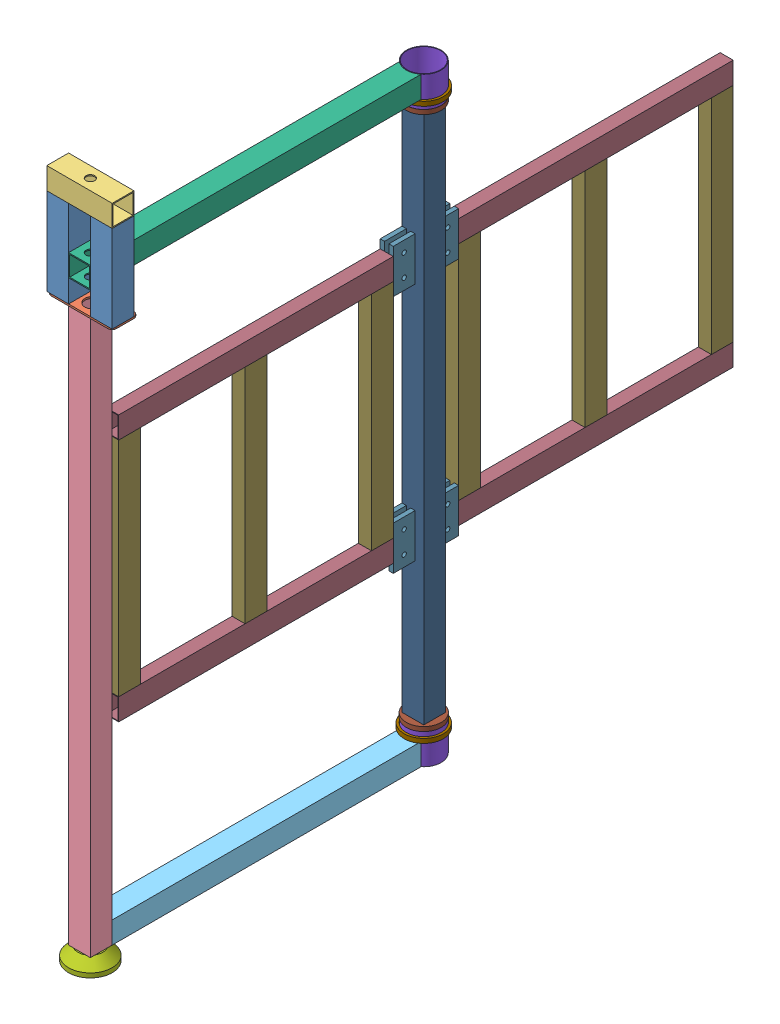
SolidWorks assembly simulation.SLDASM, configuration Default (file format 11000). Lengths in mm.
Overall size (150 1554 1520).
35 component instances, 14 part files, 39 mates.
Components (placement in the parent):
- adjuster pillars-1: adjuster pillars.SLDPRT [Default] at (28.9556 42.177 151.947) size (50 200 50)
- adjuster pillars-2: adjuster pillars.SLDPRT [Default] at (128.9556 42.177 151.947) size (50 200 50)
- base of adjuster-1: base of adjuster.SLDPRT [Default] at (78.9556 38.177 146.947) x (0 0 -1) z (1 0 0) size (60 4 150)
- top part of adjuster-1: top part of adjuster.SLDPRT [Default] at (153.9556 267.177 151.947) x (0 0 -1) z (0 1 0) size (50 150 50)
- pillar-1: pillar.SLDPRT [Default] at (78.9556 -1231.823 151.947) size (50 1270 50)
- bottom beam-1: bottom beam.SLDPRT [Default] at (78.9556 -1206.823 -613.053) x (0 1 0) z (1 0 0) size (50 708.78 50)
- top beam-1: top beam.SLDPRT [Default] at (78.9556 119.177 -613.0456) x (0 -1 0) z (-1 0 0) size (50 758.78 50)
- bases-1: bases.SLDPRT [Default] at (78.9556 -1261.823 151.947) size (100 30 100)
- pivot-1: pivot.SLDPRT [Default] at (78.9556 -1231.823 -613.053) x (-0.917246 0 0.398321) z (-0.398321 0 -0.917246) size (79.5 70 79.5)
- pivot-2: pivot.SLDPRT [Default] at (78.9556 74.177 -613.0456) x (0.999951 0 0.009934) z (-0.009934 0 0.999951) size (79.5 70 79.5)
- abstract for pivot and bearing-1: abstract for pivot and bearing.SLDPRT [Default] at (78.9556 -1181.823 -613.053) x (-0.462085 0 0.886835) z (-0.886835 0 -0.462085) size (90 10 90)
- abstract for pivot and bearing-2: abstract for pivot and bearing.SLDPRT [Default] at (78.9556 84.177 -613.0456) size (90 10 90)
- rotaric shaft-2: rotaric shaft.SLDPRT [Default] at (78.9556 -1151.823 -613.053) x (0 0 -1) z (1 0 0) size (50 1216 50)
- Part2-1: Part2.SLDPRT [Default] at (78.9556 -1161.823 -613.053) x (0.997465 0 0.071162) z (-0.071162 0 0.997465) size (80 10 80)
- Part2-2: Part2.SLDPRT [Default] at (78.9556 64.177 -613.0456) x (0.997465 0 0.071162) z (-0.071162 0 0.997465) size (80 10 80)
- blade-3: blade.SLDASM [Default] at (-409.4121 -785.2907 -312.4738) x (0 0 -1) z (1 0 0) size (680 650 30)
  - blades clumns-1: blades clumns.SLDPRT [Default] at (200.5792 19.4678 478.3677) size (50 510 30)
  - blades clumns-2: blades clumns.SLDPRT [Default] at (-89.4208 529.4678 478.3677) x (-1 0 0) z (0 0 1) size (50 510 30)
  - blades beam-1: blades beam.SLDPRT [Default] at (-404.4208 554.4678 478.3677) x (0 0 -1) z (0 -1 0) size (30 630 50)
  - blades beam-2: blades beam.SLDPRT [Default] at (225.5792 -5.5322 478.3677) x (0 0 1) z (0 -1 0) size (30 630 50)
  - blades clumns-3: blades clumns.SLDPRT [Default] at (-379.4208 19.4678 478.3677) size (50 510 30)
  - blades patch-1: blades patch.SLDPRT [Default] at (250.5792 549.4678 493.3677) x (0 1 0) z (-1 0 0) size (100 10 50)
  - blades patch-2: blades patch.SLDPRT [Default] at (250.5792 -0.5322 493.3677) x (0 1 0) z (-1 0 0) size (100 10 50)
  - blades patch-3: blades patch.SLDPRT [Default] at (250.5792 549.4678 473.3677) x (0 1 0) z (-1 0 0) size (100 10 50)
  - blades patch-6: blades patch.SLDPRT [Default] at (250.5792 -0.5322 473.3677) x (0 1 0) z (-1 0 0) size (100 10 50)
- blade-4: blade.SLDASM [Default] at (-409.4121 -236.3552 -913.6322) x (0 0 1) z (1 0 0) size (680 650 30)
  - blades clumns-1: blades clumns.SLDPRT [Default] at (200.5792 19.4678 478.3677) size (50 510 30)
  - blades clumns-2: blades clumns.SLDPRT [Default] at (-89.4208 529.4678 478.3677) x (-1 0 0) z (0 0 1) size (50 510 30)
  - blades beam-1: blades beam.SLDPRT [Default] at (-404.4208 554.4678 478.3677) x (0 0 -1) z (0 -1 0) size (30 630 50)
  - blades beam-2: blades beam.SLDPRT [Default] at (225.5792 -5.5322 478.3677) x (0 0 1) z (0 -1 0) size (30 630 50)
  - blades clumns-3: blades clumns.SLDPRT [Default] at (-379.4208 19.4678 478.3677) size (50 510 30)
  - blades patch-1: blades patch.SLDPRT [Default] at (250.5792 549.4678 493.3677) x (0 1 0) z (-1 0 0) size (100 10 50)
  - blades patch-2: blades patch.SLDPRT [Default] at (250.5792 -0.5322 493.3677) x (0 1 0) z (-1 0 0) size (100 10 50)
  - blades patch-3: blades patch.SLDPRT [Default] at (250.5792 549.4678 473.3677) x (0 1 0) z (-1 0 0) size (100 10 50)
  - blades patch-6: blades patch.SLDPRT [Default] at (250.5792 -0.5322 473.3677) x (0 1 0) z (-1 0 0) size (100 10 50)
Mates (geometry in assembly coordinates):
- Coincident1: coincident: plane of assembly; plane of assembly; plane of adjuster pillars-2 through (153.9556 242.177 126.947) normal (1 0 0); plane of base of adjuster-1 through (153.9556 42.177 176.947) normal (1 0 0)
- Coincident2: coincident: plane of assembly; plane of assembly; plane of adjuster pillars-2 through (128.9556 42.177 151.947) normal (0 -1 0); plane of base of adjuster-1 through (78.9556 42.177 146.947) normal (0 1 0)
- Coincident3: coincident: plane of assembly; plane of assembly; plane of adjuster pillars-2 through (103.9556 242.177 176.947) normal (0 0 1); plane of base of adjuster-1 through (3.9556 42.177 176.947) normal (0 0 1)
- Coincident4: coincident: plane of assembly; plane of assembly; plane of adjuster pillars-1 through (3.9556 242.177 176.947) normal (0 0 1); plane of adjuster pillars-2 through (103.9556 242.177 176.947) normal (0 0 1)
- Coincident5: coincident: plane of assembly; plane of assembly; plane of adjuster pillars-1 through (3.9556 242.177 126.947) normal (-1 0 0); plane of base of adjuster-1 through (3.9556 42.177 176.947) normal (-1 0 0)
- Coincident6: coincident: plane of assembly; plane of assembly; plane of adjuster pillars-1 through (28.9556 42.177 151.947) normal (0 -1 0); plane of base of adjuster-1 through (78.9556 42.177 146.947) normal (0 1 0)
- Coincident7: coincident: plane of assembly; plane of assembly; plane of adjuster pillars-1 through (28.9556 242.177 151.947) normal (0 1 0); plane of top part of adjuster-1 through (3.9556 242.177 176.947) normal (0 -1 0)
- Coincident8: coincident: plane of assembly; plane of assembly; plane of adjuster pillars-1 through (3.9556 242.177 126.947) normal (-1 0 0); plane of top part of adjuster-1 through (3.9556 267.177 151.947) normal (-1 0 0)
- Coincident9: coincident: plane of assembly; plane of assembly; plane of adjuster pillars-1 through (3.9556 242.177 126.947) normal (0 0 -1); plane of top part of adjuster-1 through (3.9556 242.177 126.947) normal (0 0 -1)
- Coincident11: coincident: plane of assembly; plane of assembly; plane of base of adjuster-1 through (3.9556 42.177 176.947) normal (0 0 1); plane of pillar-1 through (53.9556 38.177 176.947) normal (0 0 1)
- Coincident13: coincident: plane of assembly; plane of assembly; plane of base of adjuster-1 through (78.9556 38.177 146.947) normal (0 -1 0); plane of pillar-1 through (78.9556 38.177 151.947) normal (0 1 0)
- Coincident15: coincident: plane of assembly; plane of assembly; plane of pillar-1 through (53.9556 38.177 126.947) normal (-1 0 0); plane of bottom beam-1 through (53.9556 -1231.823 126.947) normal (-1 0 0)
- Concentric1: concentric: cylinder of assembly; cylinder of assembly; cylinder of top part of adjuster-1 through (78.9556 242.177 151.947) axis (0 1 0) radius 10; cylinder of top beam-1 through (78.9556 144.177 151.947) axis (0 -1 0) radius 10
- Coincident17: coincident: plane of assembly; plane of assembly; plane of pillar-1 through (53.9556 38.177 126.947) normal (-1 0 0); plane of top beam-1 through (53.9556 144.177 176.9544) normal (-1 0 0)
- Coincident19: coincident: plane of assembly; plane of assembly; plane of top beam-1 through (103.9556 144.177 176.9544) normal (0 1 0); plane of pivot-2 through (78.9556 144.177 -613.0456) normal (0 1 0)
- Coincident20: coincident: line of assembly; plane of assembly; line of top beam-1 through (53.9556 94.177 176.9544) axis (0 0 -1); plane of abstract for pivot and bearing-2 through (78.9556 94.177 -613.0456) normal (0 1 0)
- Coincident23: coincident: plane of assembly; plane of assembly; plane of pillar-1 through (53.9556 38.177 126.947) normal (0 0 -1); plane of bottom beam-1 through (78.9556 -1206.823 126.947) normal (0 0 1)
- Coincident24: coincident: plane of assembly; plane of assembly; plane of pillar-1 through (78.9556 -1231.823 151.947) normal (0 -1 0); plane of bottom beam-1 through (53.9556 -1231.823 126.947) normal (0 -1 0)
- ProfileCenter1: profile center: plane of bases-1 through (78.9556 -1231.823 151.947) normal (0 1 0); plane of pillar-1 through (78.9556 -1231.823 151.947) normal (0 -1 0)
- Coincident26: coincident: plane of assembly; circle of assembly; plane of bottom beam-1 through (53.9556 -1181.823 126.947) normal (0 1 0); circle of abstract for pivot and bearing-1
- Concentric9: concentric: cylinder of assembly; cylinder of assembly; cylinder of top beam-1 through (78.9556 144.177 -613.0456) axis (0 -1 0) radius 40; cylinder of pivot-2 through (78.9556 144.177 -613.0456) axis (0 -1 0) radius 39.75
- Concentric10: concentric: cylinder of assembly; cylinder of assembly; cylinder of pivot-2 through (78.9556 144.177 -613.0456) axis (0 -1 0) radius 39.75; cylinder of abstract for pivot and bearing-2 through (78.9556 94.177 -613.0456) axis (0 -1 0) radius 45
- Concentric11: concentric: cylinder of assembly; cylinder of assembly; cylinder of pivot-1 through (78.9556 -1161.823 -613.053) axis (0 -1 0) radius 39.75; cylinder of abstract for pivot and bearing-1 through (78.9556 -1171.823 -613.053) axis (0 -1 0) radius 45
- Coincident27: coincident: plane of assembly; plane of assembly; plane of bottom beam-1 through (53.9556 -1181.823 126.947) normal (0 1 0); plane of abstract for pivot and bearing-1 through (78.9556 -1181.823 -613.053) normal (0 -1 0)
- Concentric12: concentric: cylinder of assembly; cylinder of assembly; cylinder of bottom beam-1 through (78.9556 -1181.823 -613.053) axis (0 -1 0) radius 40; cylinder of abstract for pivot and bearing-1 through (78.9556 -1171.823 -613.053) axis (0 -1 0) radius 45
- Distance1: distance = 50 mm: plane of assembly; plane of assembly; plane of abstract for pivot and bearing-1 through (78.9556 -1181.823 -613.053) normal (0 -1 0); plane of pivot-1 through (78.9556 -1231.823 -613.053) normal (0 -1 0)
- Concentric15: concentric: cylinder of assembly; cylinder of assembly; cylinder of pivot-1 through (78.9556 -1161.823 -613.053) axis (0 -1 0) radius 39.75; cylinder of Part2-1 through (78.9556 -1151.823 -613.053) axis (0 -1 0) radius 40
- Coincident33: coincident: plane of assembly; plane of assembly; plane of pivot-1 through (78.9556 -1161.823 -613.053) normal (0 1 0); plane of Part2-1 through (78.9556 -1161.823 -613.053) normal (0 -1 0)
- ProfileCenter4: profile center: plane of rotaric shaft-2 through (78.9556 -1151.823 -613.053) normal (0 -1 0); plane of Part2-1 through (78.9556 -1151.823 -613.053) normal (0 1 0)
- Coincident34: coincident: plane of assembly; plane of assembly; plane of pivot-2 through (78.9556 74.177 -613.0456) normal (0 -1 0); plane of Part2-2 through (78.9556 74.177 -613.0456) normal (0 1 0)
- Concentric16: concentric: cylinder of assembly; cylinder of assembly; cylinder of pivot-2 through (78.9556 144.177 -613.0456) axis (0 -1 0) radius 39.75; cylinder of Part2-2 through (78.9556 74.177 -613.0456) axis (0 -1 0) radius 40
- Coincident35: coincident: plane of assembly; plane of assembly; plane of rotaric shaft-2 through (78.9556 64.177 -613.053) normal (0 1 0); plane of Part2-2 through (78.9556 64.177 -613.0456) normal (0 -1 0)
- Coincident36: coincident: plane of assembly; plane of assembly; plane of rotaric shaft-2 through (53.9556 64.177 -588.053) normal (0 0 1); plane of blade-3/blades patch-2 through (73.9556 -835.823 -588.053) normal (0 0 -1)
- Coincident37: coincident: plane of assembly; plane of assembly; plane of rotaric shaft-2 through (53.9556 64.177 -588.053) normal (-1 0 0); plane of blade-3/blades patch-3 through (53.9556 -235.823 -563.053) normal (-1 0 0)
- Coincident38: coincident: plane of assembly; plane of assembly; plane of rotaric shaft-2 through (53.9556 64.177 -638.053) normal (0 0 -1); plane of blade-4/blades patch-6 through (53.9556 -185.823 -638.053) normal (0 0 1)
- Coincident39: coincident: plane of assembly; plane of assembly; plane of rotaric shaft-2 through (53.9556 64.177 -588.053) normal (-1 0 0); plane of blade-4/blades clumns-1 through (53.9556 -765.823 -738.053) normal (-1 0 0)
- Coincident40: coincident: plane of assembly; plane of assembly; plane of blade-3/blades patch-3 through (53.9556 -185.823 -588.053) normal (0 1 0); plane of blade-4/blades patch-2 through (73.9556 -185.823 -638.053) normal (0 1 0)
- Distance2: distance = 250 mm: plane of assembly; plane of assembly; plane of blade-4/blades patch-6 through (53.9556 -185.823 -638.053) normal (0 1 0); plane of Part2-2 through (78.9556 64.177 -613.0456) normal (0 -1 0)
- Coincident42: coincident: plane of assembly; plane of assembly; plane of top beam-1 through (103.9556 144.177 176.9544) normal (1 0 0); plane of rotaric shaft-2 through (103.9556 64.177 -588.053) normal (1 0 0)
